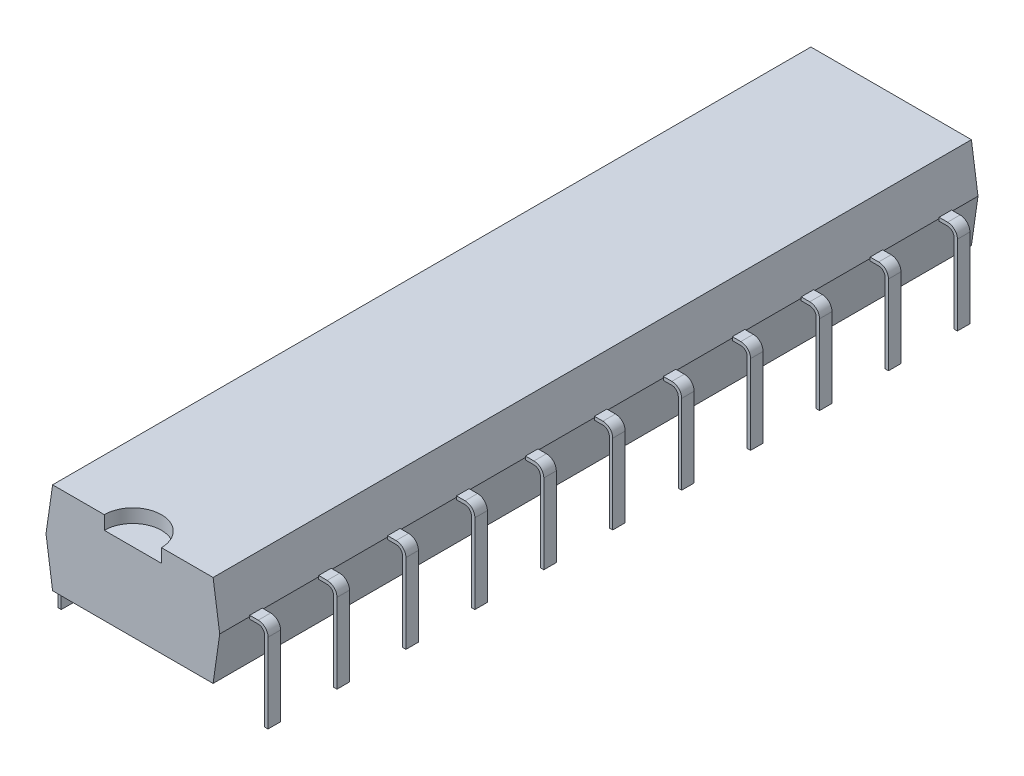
from build123d import *

# Parameters (mm, degrees)
BASE_EXTRUSION_DEPTH               = 2.54
BOSS_EXTRU_MINCE1_DEPTH            = 0.23
R_P_TITION_LIN_AIRE1_COUNT         = 11
R_P_TITION_LIN_AIRE1_PITCH         = 2.54
R_P_TITION_LIN_AIRE1_COPY_1_DEPTH  = 0.23
R_P_TITION_LIN_AIRE1_COPY_2_DEPTH  = 0.23
R_P_TITION_LIN_AIRE1_COPY_3_DEPTH  = 0.23
R_P_TITION_LIN_AIRE1_COPY_4_DEPTH  = 0.23
R_P_TITION_LIN_AIRE1_COPY_5_DEPTH  = 0.23
R_P_TITION_LIN_AIRE1_COPY_6_DEPTH  = 0.23
R_P_TITION_LIN_AIRE1_COPY_7_DEPTH  = 0.23
R_P_TITION_LIN_AIRE1_COPY_8_DEPTH  = 0.23
R_P_TITION_LIN_AIRE1_COPY_9_DEPTH  = 0.23
R_P_TITION_LIN_AIRE1_COPY_10_DEPTH = 0.23
ENL_V_MAT_EXTRU_1_DEPTH            = 0.5


with BuildPart() as part:
    # Esquisse2 → Base-Extrusion (new body)
    with BuildSketch(Plane.XY):
        Polygon((2.956959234, 0), (-2.956959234, 0), (-3.2, 1.7), (-2.956959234, 3.382234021), (2.956959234, 3.382234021), (3.2, 1.7), align=None)
    base_extrusion = extrude(amount=BASE_EXTRUSION_DEPTH)

    # Esquisse4 → Boss.-Extru.-Mince1 (add, symmetric)
    with BuildSketch(Plane.XY.offset(1.200816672)):
        with BuildLine():
            Line((3.196992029, 1.616460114), (3.51, 1.616460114))
            ThreePointArc((3.51, 1.616460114), (3.677937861, 1.546897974), (3.7475, 1.378960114))
            Line((3.7475, 1.378960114), (3.7475, -1.550308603))
            Line((3.7475, -1.550308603), (3.8725, -1.550308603))
            Line((3.8725, -1.550308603), (3.8725, 1.378960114))
            ThreePointArc((3.8725, 1.378960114), (3.766326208, 1.635286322), (3.51, 1.741460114))
            Line((3.51, 1.741460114), (3.196992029, 1.741460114))
            Line((3.196992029, 1.741460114), (3.196992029, 1.616460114))
        make_face()
    boss_extru_mince1 = extrude(amount=BOSS_EXTRU_MINCE1_DEPTH, both=True)

    # Sym_trie1: Boss.-Extru.-Mince1 across plane
    add(boss_extru_mince1.mirror(Plane(origin=(0, 0, 0), x_dir=(0, 0, 1), z_dir=(1, 0, 0))))

    # R_p_tition lin_aire1: Base-Extrusion, Boss.-Extru.-Mince1 ×11
    with Locations(*[(0, 0, -i * R_P_TITION_LIN_AIRE1_PITCH) for i in range(1, R_P_TITION_LIN_AIRE1_COUNT)]):
        add(base_extrusion)
        add(boss_extru_mince1)

    # R_p_tition lin_aire1 copy 1 sketch → R_p_tition lin_aire1 copy 1 (add, symmetric)
    with BuildSketch(Plane(origin=(0, 0, -1.339183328), x_dir=(-1, 0, 0), z_dir=(0, 0, 1))):
        with BuildLine():
            Line((3.196992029, -1.616460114), (3.51, -1.616460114))
            ThreePointArc((3.51, -1.616460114), (3.677937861, -1.546897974), (3.7475, -1.378960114))
            Line((3.7475, -1.378960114), (3.7475, 1.550308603))
            Line((3.7475, 1.550308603), (3.8725, 1.550308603))
            Line((3.8725, 1.550308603), (3.8725, -1.378960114))
            ThreePointArc((3.8725, -1.378960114), (3.766326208, -1.635286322), (3.51, -1.741460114))
            Line((3.51, -1.741460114), (3.196992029, -1.741460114))
            Line((3.196992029, -1.741460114), (3.196992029, -1.616460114))
        make_face()
    extrude(amount=R_P_TITION_LIN_AIRE1_COPY_1_DEPTH, both=True)

    # R_p_tition lin_aire1 copy 2 sketch → R_p_tition lin_aire1 copy 2 (add, symmetric)
    with BuildSketch(Plane(origin=(0, 0, -3.879183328), x_dir=(-1, 0, 0), z_dir=(0, 0, 1))):
        with BuildLine():
            Line((3.196992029, -1.616460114), (3.51, -1.616460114))
            ThreePointArc((3.51, -1.616460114), (3.677937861, -1.546897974), (3.7475, -1.378960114))
            Line((3.7475, -1.378960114), (3.7475, 1.550308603))
            Line((3.7475, 1.550308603), (3.8725, 1.550308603))
            Line((3.8725, 1.550308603), (3.8725, -1.378960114))
            ThreePointArc((3.8725, -1.378960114), (3.766326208, -1.635286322), (3.51, -1.741460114))
            Line((3.51, -1.741460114), (3.196992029, -1.741460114))
            Line((3.196992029, -1.741460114), (3.196992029, -1.616460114))
        make_face()
    extrude(amount=R_P_TITION_LIN_AIRE1_COPY_2_DEPTH, both=True)

    # R_p_tition lin_aire1 copy 3 sketch → R_p_tition lin_aire1 copy 3 (add, symmetric)
    with BuildSketch(Plane(origin=(0, 0, -6.419183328), x_dir=(-1, 0, 0), z_dir=(0, 0, 1))):
        with BuildLine():
            Line((3.196992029, -1.616460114), (3.51, -1.616460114))
            ThreePointArc((3.51, -1.616460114), (3.677937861, -1.546897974), (3.7475, -1.378960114))
            Line((3.7475, -1.378960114), (3.7475, 1.550308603))
            Line((3.7475, 1.550308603), (3.8725, 1.550308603))
            Line((3.8725, 1.550308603), (3.8725, -1.378960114))
            ThreePointArc((3.8725, -1.378960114), (3.766326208, -1.635286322), (3.51, -1.741460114))
            Line((3.51, -1.741460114), (3.196992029, -1.741460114))
            Line((3.196992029, -1.741460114), (3.196992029, -1.616460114))
        make_face()
    extrude(amount=R_P_TITION_LIN_AIRE1_COPY_3_DEPTH, both=True)

    # R_p_tition lin_aire1 copy 4 sketch → R_p_tition lin_aire1 copy 4 (add, symmetric)
    with BuildSketch(Plane(origin=(0, 0, -8.959183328), x_dir=(-1, 0, 0), z_dir=(0, 0, 1))):
        with BuildLine():
            Line((3.196992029, -1.616460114), (3.51, -1.616460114))
            ThreePointArc((3.51, -1.616460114), (3.677937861, -1.546897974), (3.7475, -1.378960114))
            Line((3.7475, -1.378960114), (3.7475, 1.550308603))
            Line((3.7475, 1.550308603), (3.8725, 1.550308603))
            Line((3.8725, 1.550308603), (3.8725, -1.378960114))
            ThreePointArc((3.8725, -1.378960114), (3.766326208, -1.635286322), (3.51, -1.741460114))
            Line((3.51, -1.741460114), (3.196992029, -1.741460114))
            Line((3.196992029, -1.741460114), (3.196992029, -1.616460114))
        make_face()
    extrude(amount=R_P_TITION_LIN_AIRE1_COPY_4_DEPTH, both=True)

    # R_p_tition lin_aire1 copy 5 sketch → R_p_tition lin_aire1 copy 5 (add, symmetric)
    with BuildSketch(Plane(origin=(0, 0, -11.499183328), x_dir=(-1, 0, 0), z_dir=(0, 0, 1))):
        with BuildLine():
            Line((3.196992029, -1.616460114), (3.51, -1.616460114))
            ThreePointArc((3.51, -1.616460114), (3.677937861, -1.546897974), (3.7475, -1.378960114))
            Line((3.7475, -1.378960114), (3.7475, 1.550308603))
            Line((3.7475, 1.550308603), (3.8725, 1.550308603))
            Line((3.8725, 1.550308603), (3.8725, -1.378960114))
            ThreePointArc((3.8725, -1.378960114), (3.766326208, -1.635286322), (3.51, -1.741460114))
            Line((3.51, -1.741460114), (3.196992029, -1.741460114))
            Line((3.196992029, -1.741460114), (3.196992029, -1.616460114))
        make_face()
    extrude(amount=R_P_TITION_LIN_AIRE1_COPY_5_DEPTH, both=True)

    # R_p_tition lin_aire1 copy 6 sketch → R_p_tition lin_aire1 copy 6 (add, symmetric)
    with BuildSketch(Plane(origin=(0, 0, -14.039183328), x_dir=(-1, 0, 0), z_dir=(0, 0, 1))):
        with BuildLine():
            Line((3.196992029, -1.616460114), (3.51, -1.616460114))
            ThreePointArc((3.51, -1.616460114), (3.677937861, -1.546897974), (3.7475, -1.378960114))
            Line((3.7475, -1.378960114), (3.7475, 1.550308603))
            Line((3.7475, 1.550308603), (3.8725, 1.550308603))
            Line((3.8725, 1.550308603), (3.8725, -1.378960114))
            ThreePointArc((3.8725, -1.378960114), (3.766326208, -1.635286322), (3.51, -1.741460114))
            Line((3.51, -1.741460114), (3.196992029, -1.741460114))
            Line((3.196992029, -1.741460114), (3.196992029, -1.616460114))
        make_face()
    extrude(amount=R_P_TITION_LIN_AIRE1_COPY_6_DEPTH, both=True)

    # R_p_tition lin_aire1 copy 7 sketch → R_p_tition lin_aire1 copy 7 (add, symmetric)
    with BuildSketch(Plane(origin=(0, 0, -16.579183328), x_dir=(-1, 0, 0), z_dir=(0, 0, 1))):
        with BuildLine():
            Line((3.196992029, -1.616460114), (3.51, -1.616460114))
            ThreePointArc((3.51, -1.616460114), (3.677937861, -1.546897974), (3.7475, -1.378960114))
            Line((3.7475, -1.378960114), (3.7475, 1.550308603))
            Line((3.7475, 1.550308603), (3.8725, 1.550308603))
            Line((3.8725, 1.550308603), (3.8725, -1.378960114))
            ThreePointArc((3.8725, -1.378960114), (3.766326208, -1.635286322), (3.51, -1.741460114))
            Line((3.51, -1.741460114), (3.196992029, -1.741460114))
            Line((3.196992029, -1.741460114), (3.196992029, -1.616460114))
        make_face()
    extrude(amount=R_P_TITION_LIN_AIRE1_COPY_7_DEPTH, both=True)

    # R_p_tition lin_aire1 copy 8 sketch → R_p_tition lin_aire1 copy 8 (add, symmetric)
    with BuildSketch(Plane(origin=(0, 0, -19.119183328), x_dir=(-1, 0, 0), z_dir=(0, 0, 1))):
        with BuildLine():
            Line((3.196992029, -1.616460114), (3.51, -1.616460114))
            ThreePointArc((3.51, -1.616460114), (3.677937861, -1.546897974), (3.7475, -1.378960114))
            Line((3.7475, -1.378960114), (3.7475, 1.550308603))
            Line((3.7475, 1.550308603), (3.8725, 1.550308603))
            Line((3.8725, 1.550308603), (3.8725, -1.378960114))
            ThreePointArc((3.8725, -1.378960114), (3.766326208, -1.635286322), (3.51, -1.741460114))
            Line((3.51, -1.741460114), (3.196992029, -1.741460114))
            Line((3.196992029, -1.741460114), (3.196992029, -1.616460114))
        make_face()
    extrude(amount=R_P_TITION_LIN_AIRE1_COPY_8_DEPTH, both=True)

    # R_p_tition lin_aire1 copy 9 sketch → R_p_tition lin_aire1 copy 9 (add, symmetric)
    with BuildSketch(Plane(origin=(0, 0, -21.659183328), x_dir=(-1, 0, 0), z_dir=(0, 0, 1))):
        with BuildLine():
            Line((3.196992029, -1.616460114), (3.51, -1.616460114))
            ThreePointArc((3.51, -1.616460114), (3.677937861, -1.546897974), (3.7475, -1.378960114))
            Line((3.7475, -1.378960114), (3.7475, 1.550308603))
            Line((3.7475, 1.550308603), (3.8725, 1.550308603))
            Line((3.8725, 1.550308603), (3.8725, -1.378960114))
            ThreePointArc((3.8725, -1.378960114), (3.766326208, -1.635286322), (3.51, -1.741460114))
            Line((3.51, -1.741460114), (3.196992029, -1.741460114))
            Line((3.196992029, -1.741460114), (3.196992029, -1.616460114))
        make_face()
    extrude(amount=R_P_TITION_LIN_AIRE1_COPY_9_DEPTH, both=True)

    # R_p_tition lin_aire1 copy 10 sketch → R_p_tition lin_aire1 copy 10 (add, symmetric)
    with BuildSketch(Plane(origin=(0, 0, -24.199183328), x_dir=(-1, 0, 0), z_dir=(0, 0, 1))):
        with BuildLine():
            Line((3.196992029, -1.616460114), (3.51, -1.616460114))
            ThreePointArc((3.51, -1.616460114), (3.677937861, -1.546897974), (3.7475, -1.378960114))
            Line((3.7475, -1.378960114), (3.7475, 1.550308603))
            Line((3.7475, 1.550308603), (3.8725, 1.550308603))
            Line((3.8725, 1.550308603), (3.8725, -1.378960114))
            ThreePointArc((3.8725, -1.378960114), (3.766326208, -1.635286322), (3.51, -1.741460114))
            Line((3.51, -1.741460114), (3.196992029, -1.741460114))
            Line((3.196992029, -1.741460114), (3.196992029, -1.616460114))
        make_face()
    extrude(amount=R_P_TITION_LIN_AIRE1_COPY_10_DEPTH, both=True)

    # Esquisse5 → Enl_v. mat.-Extru.1 (cut)
    with BuildSketch(Plane(origin=(0, 3.382234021, 0), x_dir=(-1, 0, 0), z_dir=(0, 1, 0))):
        with BuildLine():
            Line((1.052627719, 2.54), (0, 2.54))
            Line((0, 2.54), (-1.052627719, 2.54))
            ThreePointArc((-1.052627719, 2.54), (0, 1.487372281), (1.052627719, 2.54))
        make_face()
    extrude(amount=-ENL_V_MAT_EXTRU_1_DEPTH, mode=Mode.SUBTRACT)


solid = part.part
